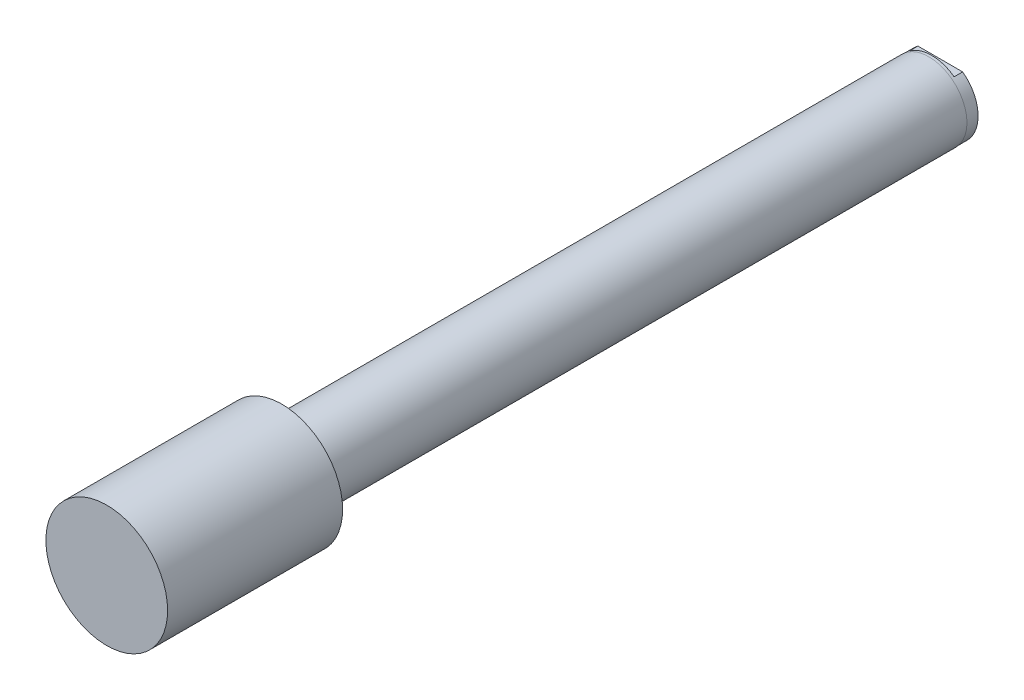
ISO-10303-21;
HEADER;
FILE_DESCRIPTION(('STEP AP214'),'2;1');
FILE_NAME('part.step','',(''),(''),'','','');
FILE_SCHEMA(('AUTOMOTIVE_DESIGN { 1 0 10303 214 1 1 1 1 }'));
ENDSEC;
DATA;
#1=APPLICATION_CONTEXT('core data for automotive mechanical design processes');
#2=APPLICATION_PROTOCOL_DEFINITION('international standard','automotive_design',2000,#1);
#3=PRODUCT_CONTEXT('',#1,'mechanical');
#4=PRODUCT('Part','Part','',(#3));
#5=PRODUCT_RELATED_PRODUCT_CATEGORY('part','',(#4));
#6=PRODUCT_DEFINITION_FORMATION('','',#4);
#7=PRODUCT_DEFINITION_CONTEXT('part definition',#1,'design');
#8=PRODUCT_DEFINITION('design','',#6,#7);
#9=PRODUCT_DEFINITION_SHAPE('','',#8);
#10=(LENGTH_UNIT() NAMED_UNIT(*) SI_UNIT(.MILLI.,.METRE.));
#11=(NAMED_UNIT(*) PLANE_ANGLE_UNIT() SI_UNIT($,.RADIAN.));
#12=(NAMED_UNIT(*) SI_UNIT($,.STERADIAN.) SOLID_ANGLE_UNIT());
#13=UNCERTAINTY_MEASURE_WITH_UNIT(LENGTH_MEASURE(1.E-05),#10,'distance_accuracy_value','');
#14=(GEOMETRIC_REPRESENTATION_CONTEXT(3) GLOBAL_UNCERTAINTY_ASSIGNED_CONTEXT((#13)) GLOBAL_UNIT_ASSIGNED_CONTEXT((#10,
#11,#12)) REPRESENTATION_CONTEXT('',''));
#15=CARTESIAN_POINT('',(0.,0.,0.));
#16=DIRECTION('',(0.,0.,1.));
#17=DIRECTION('',(1.,0.,0.));
#18=AXIS2_PLACEMENT_3D('',#15,#16,#17);
#19=CARTESIAN_POINT('',(0.,0.,27.7368));
#20=DIRECTION('',(0.,0.,-1.));
#21=DIRECTION('',(-1.,0.,0.));
#22=AXIS2_PLACEMENT_3D('',#19,#20,#21);
#23=CONICAL_SURFACE('',#22,4.96062,1.02974425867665);
#24=CARTESIAN_POINT('',(0.,0.,30.7174412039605));
#25=VERTEX_POINT('',#24);
#26=VERTEX_LOOP('',#25);
#27=FACE_BOUND('',#26,.T.);
#28=CARTESIAN_POINT('',(0.,0.,27.7368));
#29=DIRECTION('',(0.,0.,-1.));
#30=DIRECTION('',(-1.,0.,0.));
#31=AXIS2_PLACEMENT_3D('',#28,#29,#30);
#32=CIRCLE('',#31,4.96062);
#33=CARTESIAN_POINT('',(-4.96062,0.,27.7368));
#34=VERTEX_POINT('',#33);
#35=EDGE_CURVE('E93',#34,#34,#32,.T.);
#36=ORIENTED_EDGE('',*,*,#35,.T.);
#37=EDGE_LOOP('',(#36));
#38=FACE_BOUND('',#37,.T.);
#39=ADVANCED_FACE('F16',(#27,#38),#23,.F.);
#40=CARTESIAN_POINT('',(0.,0.,-4.7752));
#41=DIRECTION('',(0.,0.,-1.));
#42=DIRECTION('',(-1.,0.,0.));
#43=AXIS2_PLACEMENT_3D('',#40,#41,#42);
#44=CYLINDRICAL_SURFACE('',#43,4.96062);
#45=ORIENTED_EDGE('',*,*,#35,.F.);
#46=EDGE_LOOP('',(#45));
#47=FACE_BOUND('',#46,.T.);
#48=CARTESIAN_POINT('',(0.,0.,-4.7752));
#49=DIRECTION('',(0.,0.,-1.));
#50=DIRECTION('',(-1.,0.,0.));
#51=AXIS2_PLACEMENT_3D('',#48,#49,#50);
#52=CIRCLE('',#51,4.96062);
#53=CARTESIAN_POINT('',(-4.96062,0.,-4.7752));
#54=VERTEX_POINT('',#53);
#55=EDGE_CURVE('E97',#54,#54,#52,.T.);
#56=ORIENTED_EDGE('',*,*,#55,.T.);
#57=EDGE_LOOP('',(#56));
#58=FACE_BOUND('',#57,.T.);
#59=ADVANCED_FACE('F131',(#47,#58),#44,.F.);
#60=CARTESIAN_POINT('',(0.,0.,-1.2192));
#61=DIRECTION('',(0.,0.,-1.));
#62=DIRECTION('',(-1.,0.,0.));
#63=AXIS2_PLACEMENT_3D('',#60,#61,#62);
#64=PLANE('',#63);
#65=CARTESIAN_POINT('',(0.,0.,-1.2192));
#66=DIRECTION('',(0.,0.,-1.));
#67=DIRECTION('',(-1.,0.,0.));
#68=AXIS2_PLACEMENT_3D('',#65,#66,#67);
#69=CIRCLE('',#68,15.7607);
#70=CARTESIAN_POINT('',(9.33325583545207,-12.7,-1.2192));
#71=VERTEX_POINT('',#70);
#72=CARTESIAN_POINT('',(-9.33325583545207,-12.7,-1.2192));
#73=VERTEX_POINT('',#72);
#74=EDGE_CURVE('E65',#71,#73,#69,.T.);
#75=ORIENTED_EDGE('',*,*,#74,.T.);
#76=DIRECTION('',(1.,0.,0.));
#77=VECTOR('',#76,1.);
#78=CARTESIAN_POINT('',(9.33325583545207,-12.7,-1.2192));
#79=LINE('',#78,#77);
#80=EDGE_CURVE('E67',#73,#71,#79,.T.);
#81=ORIENTED_EDGE('',*,*,#80,.T.);
#82=EDGE_LOOP('',(#75,#81));
#83=FACE_BOUND('',#82,.T.);
#84=ADVANCED_FACE('F66',(#83),#64,.T.);
#85=CARTESIAN_POINT('',(0.,0.,-1.2192));
#86=DIRECTION('',(0.,0.,-1.));
#87=DIRECTION('',(-1.,0.,0.));
#88=AXIS2_PLACEMENT_3D('',#85,#86,#87);
#89=PLANE('',#88);
#90=CARTESIAN_POINT('',(0.,0.,-1.2192));
#91=DIRECTION('',(0.,0.,-1.));
#92=DIRECTION('',(-1.,0.,0.));
#93=AXIS2_PLACEMENT_3D('',#90,#91,#92);
#94=CIRCLE('',#93,15.7607);
#95=CARTESIAN_POINT('',(-9.33325583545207,12.7,-1.2192));
#96=VERTEX_POINT('',#95);
#97=CARTESIAN_POINT('',(9.33325583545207,12.7,-1.2192));
#98=VERTEX_POINT('',#97);
#99=EDGE_CURVE('E85',#96,#98,#94,.T.);
#100=ORIENTED_EDGE('',*,*,#99,.T.);
#101=DIRECTION('',(-1.,0.,0.));
#102=VECTOR('',#101,1.);
#103=CARTESIAN_POINT('',(9.33325583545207,12.7,-1.2192));
#104=LINE('',#103,#102);
#105=EDGE_CURVE('E87',#98,#96,#104,.T.);
#106=ORIENTED_EDGE('',*,*,#105,.T.);
#107=EDGE_LOOP('',(#100,#106));
#108=FACE_BOUND('',#107,.T.);
#109=ADVANCED_FACE('F121',(#108),#89,.T.);
#110=CARTESIAN_POINT('',(9.33325583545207,12.7,-1.2192));
#111=DIRECTION('',(0.,-1.,0.));
#112=DIRECTION('',(0.,0.,1.));
#113=AXIS2_PLACEMENT_3D('',#110,#111,#112);
#114=PLANE('',#113);
#115=DIRECTION('',(-1.,0.,0.));
#116=VECTOR('',#115,1.);
#117=CARTESIAN_POINT('',(9.33325583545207,12.7,-4.7752));
#118=LINE('',#117,#116);
#119=CARTESIAN_POINT('',(9.33325583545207,12.7,-4.7752));
#120=VERTEX_POINT('',#119);
#121=CARTESIAN_POINT('',(-9.33325583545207,12.7,-4.7752));
#122=VERTEX_POINT('',#121);
#123=EDGE_CURVE('E81',#120,#122,#118,.T.);
#124=ORIENTED_EDGE('',*,*,#123,.T.);
#125=DIRECTION('',(0.,0.,-1.));
#126=VECTOR('',#125,1.);
#127=CARTESIAN_POINT('',(-9.33325583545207,12.7,-1.2192));
#128=LINE('',#127,#126);
#129=EDGE_CURVE('E91',#96,#122,#128,.T.);
#130=ORIENTED_EDGE('',*,*,#129,.F.);
#131=ORIENTED_EDGE('',*,*,#105,.F.);
#132=DIRECTION('',(0.,0.,-1.));
#133=VECTOR('',#132,1.);
#134=CARTESIAN_POINT('',(9.33325583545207,12.7,-1.2192));
#135=LINE('',#134,#133);
#136=EDGE_CURVE('E41',#98,#120,#135,.T.);
#137=ORIENTED_EDGE('',*,*,#136,.T.);
#138=EDGE_LOOP('',(#124,#130,#131,#137));
#139=FACE_BOUND('',#138,.T.);
#140=ADVANCED_FACE('F118',(#139),#114,.F.);
#141=CARTESIAN_POINT('',(0.,0.,-4.7752));
#142=DIRECTION('',(0.,0.,-1.));
#143=DIRECTION('',(-1.,0.,0.));
#144=AXIS2_PLACEMENT_3D('',#141,#142,#143);
#145=PLANE('',#144);
#146=DIRECTION('',(1.,0.,0.));
#147=VECTOR('',#146,1.);
#148=CARTESIAN_POINT('',(9.33325583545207,-12.7,-4.7752));
#149=LINE('',#148,#147);
#150=CARTESIAN_POINT('',(-9.33325583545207,-12.7,-4.7752));
#151=VERTEX_POINT('',#150);
#152=CARTESIAN_POINT('',(9.33325583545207,-12.7,-4.7752));
#153=VERTEX_POINT('',#152);
#154=EDGE_CURVE('E70',#151,#153,#149,.T.);
#155=ORIENTED_EDGE('',*,*,#154,.F.);
#156=CARTESIAN_POINT('',(0.,0.,-4.7752));
#157=DIRECTION('',(0.,0.,-1.));
#158=DIRECTION('',(-1.,0.,0.));
#159=AXIS2_PLACEMENT_3D('',#156,#157,#158);
#160=CIRCLE('',#159,15.7607);
#161=EDGE_CURVE('E79',#151,#122,#160,.T.);
#162=ORIENTED_EDGE('',*,*,#161,.T.);
#163=ORIENTED_EDGE('',*,*,#123,.F.);
#164=EDGE_CURVE('E25',#120,#153,#160,.T.);
#165=ORIENTED_EDGE('',*,*,#164,.T.);
#166=EDGE_LOOP('',(#155,#162,#163,#165));
#167=FACE_BOUND('',#166,.T.);
#168=ORIENTED_EDGE('',*,*,#55,.F.);
#169=EDGE_LOOP('',(#168));
#170=FACE_BOUND('',#169,.T.);
#171=ADVANCED_FACE('F116',(#167,#170),#145,.T.);
#172=CARTESIAN_POINT('',(9.33325583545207,-12.7,-1.2192));
#173=DIRECTION('',(0.,1.,0.));
#174=DIRECTION('',(0.,0.,-1.));
#175=AXIS2_PLACEMENT_3D('',#172,#173,#174);
#176=PLANE('',#175);
#177=ORIENTED_EDGE('',*,*,#154,.T.);
#178=DIRECTION('',(0.,0.,-1.));
#179=VECTOR('',#178,1.);
#180=CARTESIAN_POINT('',(9.33325583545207,-12.7,-1.2192));
#181=LINE('',#180,#179);
#182=EDGE_CURVE('E73',#71,#153,#181,.T.);
#183=ORIENTED_EDGE('',*,*,#182,.F.);
#184=ORIENTED_EDGE('',*,*,#80,.F.);
#185=DIRECTION('',(0.,0.,-1.));
#186=VECTOR('',#185,1.);
#187=CARTESIAN_POINT('',(-9.33325583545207,-12.7,-1.2192));
#188=LINE('',#187,#186);
#189=EDGE_CURVE('E33',#73,#151,#188,.T.);
#190=ORIENTED_EDGE('',*,*,#189,.T.);
#191=EDGE_LOOP('',(#177,#183,#184,#190));
#192=FACE_BOUND('',#191,.T.);
#193=ADVANCED_FACE('F72',(#192),#176,.F.);
#194=CARTESIAN_POINT('',(0.,0.,0.));
#195=DIRECTION('',(0.,0.,-1.));
#196=DIRECTION('',(-1.,0.,0.));
#197=AXIS2_PLACEMENT_3D('',#194,#195,#196);
#198=CYLINDRICAL_SURFACE('',#197,15.7607);
#199=ORIENTED_EDGE('',*,*,#182,.T.);
#200=ORIENTED_EDGE('',*,*,#164,.F.);
#201=ORIENTED_EDGE('',*,*,#136,.F.);
#202=ORIENTED_EDGE('',*,*,#99,.F.);
#203=ORIENTED_EDGE('',*,*,#129,.T.);
#204=ORIENTED_EDGE('',*,*,#161,.F.);
#205=ORIENTED_EDGE('',*,*,#189,.F.);
#206=ORIENTED_EDGE('',*,*,#74,.F.);
#207=EDGE_LOOP('',(#199,#200,#201,#202,#203,#204,#205,#206));
#208=FACE_BOUND('',#207,.T.);
#209=CARTESIAN_POINT('',(0.,0.,0.));
#210=DIRECTION('',(0.,0.,-1.));
#211=DIRECTION('',(-1.,0.,0.));
#212=AXIS2_PLACEMENT_3D('',#209,#210,#211);
#213=CIRCLE('',#212,15.7607);
#214=CARTESIAN_POINT('',(-15.7607,0.,0.));
#215=VERTEX_POINT('',#214);
#216=EDGE_CURVE('E10',#215,#215,#213,.T.);
#217=ORIENTED_EDGE('',*,*,#216,.T.);
#218=EDGE_LOOP('',(#217));
#219=FACE_BOUND('',#218,.T.);
#220=ADVANCED_FACE('F76',(#208,#219),#198,.T.);
#221=CARTESIAN_POINT('',(0.,0.,343.0524));
#222=DIRECTION('',(0.,0.,1.));
#223=DIRECTION('',(1.,0.,0.));
#224=AXIS2_PLACEMENT_3D('',#221,#222,#223);
#225=PLANE('',#224);
#226=CARTESIAN_POINT('',(0.,0.,343.0524));
#227=DIRECTION('',(0.,0.,1.));
#228=DIRECTION('',(1.,0.,0.));
#229=AXIS2_PLACEMENT_3D('',#226,#227,#228);
#230=CIRCLE('',#229,25.4);
#231=CARTESIAN_POINT('',(25.4,0.,343.0524));
#232=VERTEX_POINT('',#231);
#233=EDGE_CURVE('E102',#232,#232,#230,.T.);
#234=ORIENTED_EDGE('',*,*,#233,.T.);
#235=EDGE_LOOP('',(#234));
#236=FACE_BOUND('',#235,.T.);
#237=ADVANCED_FACE('F149',(#236),#225,.T.);
#238=CARTESIAN_POINT('',(0.,0.,343.0524));
#239=DIRECTION('',(0.,0.,-1.));
#240=DIRECTION('',(-1.,0.,0.));
#241=AXIS2_PLACEMENT_3D('',#238,#239,#240);
#242=CYLINDRICAL_SURFACE('',#241,25.4);
#243=ORIENTED_EDGE('',*,*,#233,.F.);
#244=EDGE_LOOP('',(#243));
#245=FACE_BOUND('',#244,.T.);
#246=CARTESIAN_POINT('',(0.,0.,270.0274));
#247=DIRECTION('',(0.,0.,1.));
#248=DIRECTION('',(1.,0.,0.));
#249=AXIS2_PLACEMENT_3D('',#246,#247,#248);
#250=CIRCLE('',#249,25.4);
#251=CARTESIAN_POINT('',(25.4,0.,270.0274));
#252=VERTEX_POINT('',#251);
#253=EDGE_CURVE('E106',#252,#252,#250,.T.);
#254=ORIENTED_EDGE('',*,*,#253,.T.);
#255=EDGE_LOOP('',(#254));
#256=FACE_BOUND('',#255,.T.);
#257=ADVANCED_FACE('F152',(#245,#256),#242,.T.);
#258=CARTESIAN_POINT('',(0.,0.,270.0274));
#259=DIRECTION('',(0.,0.,1.));
#260=DIRECTION('',(1.,0.,0.));
#261=AXIS2_PLACEMENT_3D('',#258,#259,#260);
#262=PLANE('',#261);
#263=CARTESIAN_POINT('',(0.,0.,270.0274));
#264=DIRECTION('',(0.,0.,1.));
#265=DIRECTION('',(1.,0.,0.));
#266=AXIS2_PLACEMENT_3D('',#263,#264,#265);
#267=CIRCLE('',#266,15.875);
#268=CARTESIAN_POINT('',(15.875,0.,270.0274));
#269=VERTEX_POINT('',#268);
#270=EDGE_CURVE('E105',#269,#269,#267,.F.);
#271=ORIENTED_EDGE('',*,*,#270,.F.);
#272=EDGE_LOOP('',(#271));
#273=FACE_BOUND('',#272,.T.);
#274=ORIENTED_EDGE('',*,*,#253,.F.);
#275=EDGE_LOOP('',(#274));
#276=FACE_BOUND('',#275,.T.);
#277=ADVANCED_FACE('F154',(#273,#276),#262,.F.);
#278=CARTESIAN_POINT('',(0.,0.,270.0274));
#279=DIRECTION('',(0.,0.,-1.));
#280=DIRECTION('',(-1.,0.,0.));
#281=AXIS2_PLACEMENT_3D('',#278,#279,#280);
#282=CYLINDRICAL_SURFACE('',#281,15.875);
#283=CARTESIAN_POINT('',(0.,0.,0.));
#284=DIRECTION('',(0.,0.,-1.));
#285=DIRECTION('',(-1.,0.,0.));
#286=AXIS2_PLACEMENT_3D('',#283,#284,#285);
#287=CIRCLE('',#286,15.875);
#288=CARTESIAN_POINT('',(-15.875,0.,0.));
#289=VERTEX_POINT('',#288);
#290=EDGE_CURVE('E20',#289,#289,#287,.T.);
#291=ORIENTED_EDGE('',*,*,#290,.F.);
#292=EDGE_LOOP('',(#291));
#293=FACE_BOUND('',#292,.T.);
#294=ORIENTED_EDGE('',*,*,#270,.T.);
#295=EDGE_LOOP('',(#294));
#296=FACE_BOUND('',#295,.T.);
#297=ADVANCED_FACE('F18',(#293,#296),#282,.T.);
#298=CARTESIAN_POINT('',(0.,0.,0.));
#299=DIRECTION('',(0.,0.,-1.));
#300=DIRECTION('',(-1.,0.,0.));
#301=AXIS2_PLACEMENT_3D('',#298,#299,#300);
#302=PLANE('',#301);
#303=ORIENTED_EDGE('',*,*,#290,.T.);
#304=EDGE_LOOP('',(#303));
#305=FACE_BOUND('',#304,.T.);
#306=ORIENTED_EDGE('',*,*,#216,.F.);
#307=EDGE_LOOP('',(#306));
#308=FACE_BOUND('',#307,.T.);
#309=ADVANCED_FACE('F158',(#305,#308),#302,.T.);
#310=CLOSED_SHELL('',(#39,#59,#84,#109,#140,#171,#193,#220,#237,#257,#277,#297,#309));
#311=MANIFOLD_SOLID_BREP('B1',#310);
#312=ADVANCED_BREP_SHAPE_REPRESENTATION('',(#18,#311),#14);
#313=SHAPE_DEFINITION_REPRESENTATION(#9,#312);
ENDSEC;
END-ISO-10303-21;
